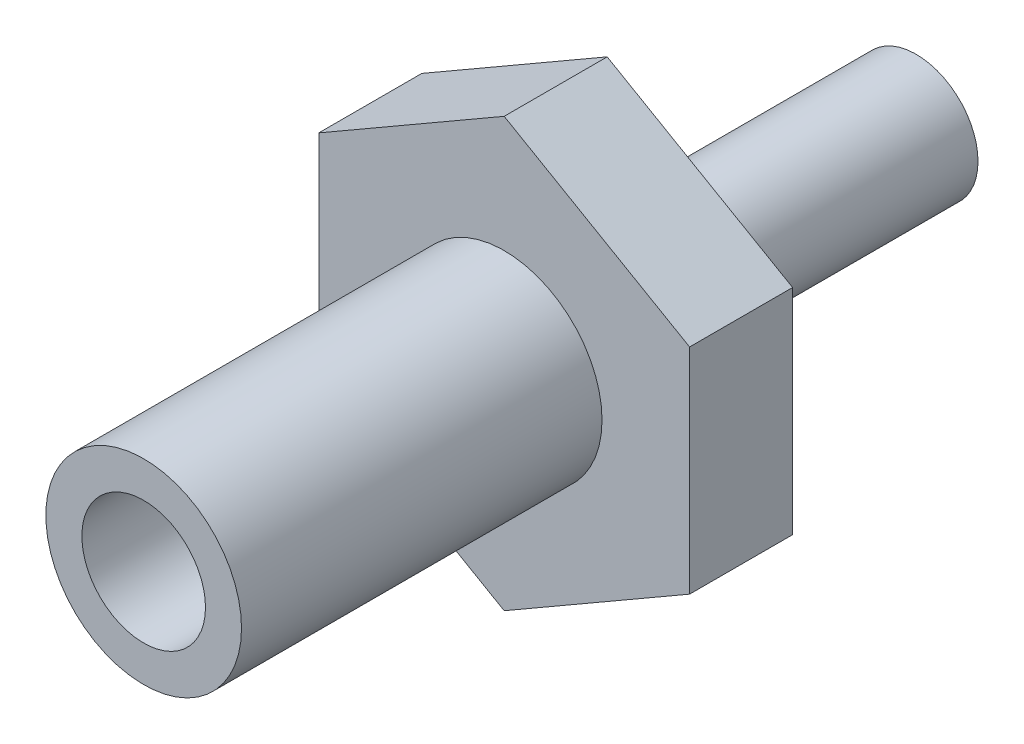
ISO-10303-21;
HEADER;
FILE_DESCRIPTION(('STEP AP214'),'2;1');
FILE_NAME('part.step','',(''),(''),'','','');
FILE_SCHEMA(('AUTOMOTIVE_DESIGN { 1 0 10303 214 1 1 1 1 }'));
ENDSEC;
DATA;
#1=APPLICATION_CONTEXT('core data for automotive mechanical design processes');
#2=APPLICATION_PROTOCOL_DEFINITION('international standard','automotive_design',2000,#1);
#3=PRODUCT_CONTEXT('',#1,'mechanical');
#4=PRODUCT('Part','Part','',(#3));
#5=PRODUCT_RELATED_PRODUCT_CATEGORY('part','',(#4));
#6=PRODUCT_DEFINITION_FORMATION('','',#4);
#7=PRODUCT_DEFINITION_CONTEXT('part definition',#1,'design');
#8=PRODUCT_DEFINITION('design','',#6,#7);
#9=PRODUCT_DEFINITION_SHAPE('','',#8);
#10=(LENGTH_UNIT() NAMED_UNIT(*) SI_UNIT(.MILLI.,.METRE.));
#11=(NAMED_UNIT(*) PLANE_ANGLE_UNIT() SI_UNIT($,.RADIAN.));
#12=(NAMED_UNIT(*) SI_UNIT($,.STERADIAN.) SOLID_ANGLE_UNIT());
#13=UNCERTAINTY_MEASURE_WITH_UNIT(LENGTH_MEASURE(1.E-05),#10,'distance_accuracy_value','');
#14=(GEOMETRIC_REPRESENTATION_CONTEXT(3) GLOBAL_UNCERTAINTY_ASSIGNED_CONTEXT((#13)) GLOBAL_UNIT_ASSIGNED_CONTEXT((#10,
#11,#12)) REPRESENTATION_CONTEXT('',''));
#15=CARTESIAN_POINT('',(0.,0.,0.));
#16=DIRECTION('',(0.,0.,1.));
#17=DIRECTION('',(1.,0.,0.));
#18=AXIS2_PLACEMENT_3D('',#15,#16,#17);
#19=CARTESIAN_POINT('',(22.,0.,10.));
#20=DIRECTION('',(0.,0.,-1.));
#21=DIRECTION('',(-1.,0.,0.));
#22=AXIS2_PLACEMENT_3D('',#19,#20,#21);
#23=PLANE('',#22);
#24=DIRECTION('',(-0.866025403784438,0.5,0.));
#25=VECTOR('',#24,1.);
#26=CARTESIAN_POINT('',(0.,-20.7846096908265,10.));
#27=LINE('',#26,#25);
#28=CARTESIAN_POINT('',(0.,-20.7846096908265,10.));
#29=VERTEX_POINT('',#28);
#30=CARTESIAN_POINT('',(-18.,-10.3923048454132,10.));
#31=VERTEX_POINT('',#30);
#32=EDGE_CURVE('E95',#29,#31,#27,.T.);
#33=ORIENTED_EDGE('',*,*,#32,.F.);
#34=DIRECTION('',(0.866025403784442,0.5,0.));
#35=VECTOR('',#34,1.);
#36=CARTESIAN_POINT('',(0.,-20.7846096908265,10.));
#37=LINE('',#36,#35);
#38=CARTESIAN_POINT('',(18.,-10.3923048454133,10.));
#39=VERTEX_POINT('',#38);
#40=EDGE_CURVE('E37',#29,#39,#37,.T.);
#41=ORIENTED_EDGE('',*,*,#40,.T.);
#42=DIRECTION('',(0.,-1.,0.));
#43=VECTOR('',#42,1.);
#44=CARTESIAN_POINT('',(18.,10.3923048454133,10.));
#45=LINE('',#44,#43);
#46=CARTESIAN_POINT('',(18.,10.3923048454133,10.));
#47=VERTEX_POINT('',#46);
#48=EDGE_CURVE('E74',#47,#39,#45,.T.);
#49=ORIENTED_EDGE('',*,*,#48,.F.);
#50=DIRECTION('',(0.866025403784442,-0.5,0.));
#51=VECTOR('',#50,1.);
#52=CARTESIAN_POINT('',(0.,20.7846096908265,10.));
#53=LINE('',#52,#51);
#54=CARTESIAN_POINT('',(0.,20.7846096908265,10.));
#55=VERTEX_POINT('',#54);
#56=EDGE_CURVE('E104',#55,#47,#53,.T.);
#57=ORIENTED_EDGE('',*,*,#56,.F.);
#58=DIRECTION('',(-0.866025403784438,-0.5,0.));
#59=VECTOR('',#58,1.);
#60=CARTESIAN_POINT('',(0.,20.7846096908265,10.));
#61=LINE('',#60,#59);
#62=CARTESIAN_POINT('',(-18.,10.3923048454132,10.));
#63=VERTEX_POINT('',#62);
#64=EDGE_CURVE('E101',#55,#63,#61,.T.);
#65=ORIENTED_EDGE('',*,*,#64,.T.);
#66=DIRECTION('',(0.,-1.,0.));
#67=VECTOR('',#66,1.);
#68=CARTESIAN_POINT('',(-18.,10.3923048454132,10.));
#69=LINE('',#68,#67);
#70=EDGE_CURVE('E98',#63,#31,#69,.T.);
#71=ORIENTED_EDGE('',*,*,#70,.T.);
#72=EDGE_LOOP('',(#33,#41,#49,#57,#65,#71));
#73=FACE_BOUND('',#72,.T.);
#74=CARTESIAN_POINT('',(0.,0.,10.));
#75=DIRECTION('',(0.,0.,1.));
#76=DIRECTION('',(1.,0.,0.));
#77=AXIS2_PLACEMENT_3D('',#74,#75,#76);
#78=CIRCLE('',#77,9.5);
#79=CARTESIAN_POINT('',(9.50000000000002,0.,10.));
#80=VERTEX_POINT('',#79);
#81=EDGE_CURVE('E9',#80,#80,#78,.T.);
#82=ORIENTED_EDGE('',*,*,#81,.F.);
#83=EDGE_LOOP('',(#82));
#84=FACE_BOUND('',#83,.T.);
#85=ADVANCED_FACE('F14',(#73,#84),#23,.F.);
#86=CARTESIAN_POINT('',(0.,0.,55.));
#87=DIRECTION('',(0.,0.,1.));
#88=DIRECTION('',(1.,0.,0.));
#89=AXIS2_PLACEMENT_3D('',#86,#87,#88);
#90=CYLINDRICAL_SURFACE('',#89,9.5);
#91=CARTESIAN_POINT('',(0.,0.,45.));
#92=DIRECTION('',(0.,0.,1.));
#93=DIRECTION('',(1.,0.,0.));
#94=AXIS2_PLACEMENT_3D('',#91,#92,#93);
#95=CIRCLE('',#94,9.5);
#96=CARTESIAN_POINT('',(9.50000000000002,0.,45.));
#97=VERTEX_POINT('',#96);
#98=EDGE_CURVE('E22',#97,#97,#95,.T.);
#99=ORIENTED_EDGE('',*,*,#98,.F.);
#100=EDGE_LOOP('',(#99));
#101=FACE_BOUND('',#100,.T.);
#102=ORIENTED_EDGE('',*,*,#81,.T.);
#103=EDGE_LOOP('',(#102));
#104=FACE_BOUND('',#103,.T.);
#105=ADVANCED_FACE('F133',(#101,#104),#90,.T.);
#106=CARTESIAN_POINT('',(9.5,0.,45.));
#107=DIRECTION('',(0.,0.,-1.));
#108=DIRECTION('',(-1.,0.,0.));
#109=AXIS2_PLACEMENT_3D('',#106,#107,#108);
#110=PLANE('',#109);
#111=CARTESIAN_POINT('',(0.,0.,45.));
#112=DIRECTION('',(0.,0.,1.));
#113=DIRECTION('',(1.,0.,0.));
#114=AXIS2_PLACEMENT_3D('',#111,#112,#113);
#115=CIRCLE('',#114,6.);
#116=CARTESIAN_POINT('',(6.00000000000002,0.,45.));
#117=VERTEX_POINT('',#116);
#118=EDGE_CURVE('E126',#117,#117,#115,.T.);
#119=ORIENTED_EDGE('',*,*,#118,.F.);
#120=EDGE_LOOP('',(#119));
#121=FACE_BOUND('',#120,.T.);
#122=ORIENTED_EDGE('',*,*,#98,.T.);
#123=EDGE_LOOP('',(#122));
#124=FACE_BOUND('',#123,.T.);
#125=ADVANCED_FACE('F131',(#121,#124),#110,.F.);
#126=CARTESIAN_POINT('',(0.,0.,55.));
#127=DIRECTION('',(0.,0.,1.));
#128=DIRECTION('',(1.,0.,0.));
#129=AXIS2_PLACEMENT_3D('',#126,#127,#128);
#130=CYLINDRICAL_SURFACE('',#129,6.);
#131=CARTESIAN_POINT('',(0.,0.,16.));
#132=DIRECTION('',(0.,0.,1.));
#133=DIRECTION('',(1.,0.,0.));
#134=AXIS2_PLACEMENT_3D('',#131,#132,#133);
#135=CIRCLE('',#134,6.);
#136=CARTESIAN_POINT('',(6.00000000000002,0.,16.));
#137=VERTEX_POINT('',#136);
#138=EDGE_CURVE('E123',#137,#137,#135,.T.);
#139=ORIENTED_EDGE('',*,*,#138,.F.);
#140=EDGE_LOOP('',(#139));
#141=FACE_BOUND('',#140,.T.);
#142=ORIENTED_EDGE('',*,*,#118,.T.);
#143=EDGE_LOOP('',(#142));
#144=FACE_BOUND('',#143,.T.);
#145=ADVANCED_FACE('F149',(#141,#144),#130,.F.);
#146=CARTESIAN_POINT('',(6.,0.,16.));
#147=DIRECTION('',(0.,0.,-1.));
#148=DIRECTION('',(-1.,0.,0.));
#149=AXIS2_PLACEMENT_3D('',#146,#147,#148);
#150=PLANE('',#149);
#151=ORIENTED_EDGE('',*,*,#138,.T.);
#152=EDGE_LOOP('',(#151));
#153=FACE_BOUND('',#152,.T.);
#154=ADVANCED_FACE('F153',(#153),#150,.F.);
#155=CARTESIAN_POINT('',(0.,-20.7846096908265,10.));
#156=DIRECTION('',(-0.5,0.866025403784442,0.));
#157=DIRECTION('',(-0.866025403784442,-0.5,0.));
#158=AXIS2_PLACEMENT_3D('',#155,#156,#157);
#159=PLANE('',#158);
#160=DIRECTION('',(0.,0.,-1.));
#161=VECTOR('',#160,1.);
#162=CARTESIAN_POINT('',(18.,-10.3923048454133,10.));
#163=LINE('',#162,#161);
#164=CARTESIAN_POINT('',(18.,-10.3923048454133,0.));
#165=VERTEX_POINT('',#164);
#166=EDGE_CURVE('E67',#39,#165,#163,.T.);
#167=ORIENTED_EDGE('',*,*,#166,.F.);
#168=ORIENTED_EDGE('',*,*,#40,.F.);
#169=DIRECTION('',(0.,0.,-1.));
#170=VECTOR('',#169,1.);
#171=CARTESIAN_POINT('',(0.,-20.7846096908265,10.));
#172=LINE('',#171,#170);
#173=CARTESIAN_POINT('',(0.,-20.7846096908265,0.));
#174=VERTEX_POINT('',#173);
#175=EDGE_CURVE('E81',#29,#174,#172,.T.);
#176=ORIENTED_EDGE('',*,*,#175,.T.);
#177=DIRECTION('',(0.866025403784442,0.5,0.));
#178=VECTOR('',#177,1.);
#179=CARTESIAN_POINT('',(0.,-20.7846096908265,0.));
#180=LINE('',#179,#178);
#181=EDGE_CURVE('E79',#174,#165,#180,.T.);
#182=ORIENTED_EDGE('',*,*,#181,.T.);
#183=EDGE_LOOP('',(#167,#168,#176,#182));
#184=FACE_BOUND('',#183,.T.);
#185=ADVANCED_FACE('F80',(#184),#159,.F.);
#186=CARTESIAN_POINT('',(18.,10.3923048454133,10.));
#187=DIRECTION('',(1.,0.,0.));
#188=DIRECTION('',(0.,0.,-1.));
#189=AXIS2_PLACEMENT_3D('',#186,#187,#188);
#190=PLANE('',#189);
#191=DIRECTION('',(0.,0.,-1.));
#192=VECTOR('',#191,1.);
#193=CARTESIAN_POINT('',(18.,10.3923048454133,10.));
#194=LINE('',#193,#192);
#195=CARTESIAN_POINT('',(18.,10.3923048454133,0.));
#196=VERTEX_POINT('',#195);
#197=EDGE_CURVE('E76',#47,#196,#194,.T.);
#198=ORIENTED_EDGE('',*,*,#197,.F.);
#199=ORIENTED_EDGE('',*,*,#48,.T.);
#200=ORIENTED_EDGE('',*,*,#166,.T.);
#201=DIRECTION('',(0.,-1.,0.));
#202=VECTOR('',#201,1.);
#203=CARTESIAN_POINT('',(18.,10.3923048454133,0.));
#204=LINE('',#203,#202);
#205=EDGE_CURVE('E71',#196,#165,#204,.T.);
#206=ORIENTED_EDGE('',*,*,#205,.F.);
#207=EDGE_LOOP('',(#198,#199,#200,#206));
#208=FACE_BOUND('',#207,.T.);
#209=ADVANCED_FACE('F69',(#208),#190,.T.);
#210=CARTESIAN_POINT('',(0.,20.7846096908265,10.));
#211=DIRECTION('',(0.5,0.866025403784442,0.));
#212=DIRECTION('',(-0.866025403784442,0.5,0.));
#213=AXIS2_PLACEMENT_3D('',#210,#211,#212);
#214=PLANE('',#213);
#215=DIRECTION('',(0.,0.,-1.));
#216=VECTOR('',#215,1.);
#217=CARTESIAN_POINT('',(0.,20.7846096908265,10.));
#218=LINE('',#217,#216);
#219=CARTESIAN_POINT('',(0.,20.7846096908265,0.));
#220=VERTEX_POINT('',#219);
#221=EDGE_CURVE('E115',#55,#220,#218,.T.);
#222=ORIENTED_EDGE('',*,*,#221,.F.);
#223=ORIENTED_EDGE('',*,*,#56,.T.);
#224=ORIENTED_EDGE('',*,*,#197,.T.);
#225=DIRECTION('',(0.866025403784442,-0.5,0.));
#226=VECTOR('',#225,1.);
#227=CARTESIAN_POINT('',(0.,20.7846096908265,0.));
#228=LINE('',#227,#226);
#229=EDGE_CURVE('E89',#220,#196,#228,.T.);
#230=ORIENTED_EDGE('',*,*,#229,.F.);
#231=EDGE_LOOP('',(#222,#223,#224,#230));
#232=FACE_BOUND('',#231,.T.);
#233=ADVANCED_FACE('F169',(#232),#214,.T.);
#234=CARTESIAN_POINT('',(0.,20.7846096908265,10.));
#235=DIRECTION('',(0.5,-0.866025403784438,0.));
#236=DIRECTION('',(0.866025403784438,0.5,0.));
#237=AXIS2_PLACEMENT_3D('',#234,#235,#236);
#238=PLANE('',#237);
#239=DIRECTION('',(0.,0.,-1.));
#240=VECTOR('',#239,1.);
#241=CARTESIAN_POINT('',(-18.,10.3923048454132,10.));
#242=LINE('',#241,#240);
#243=CARTESIAN_POINT('',(-18.,10.3923048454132,0.));
#244=VERTEX_POINT('',#243);
#245=EDGE_CURVE('E113',#63,#244,#242,.T.);
#246=ORIENTED_EDGE('',*,*,#245,.F.);
#247=ORIENTED_EDGE('',*,*,#64,.F.);
#248=ORIENTED_EDGE('',*,*,#221,.T.);
#249=DIRECTION('',(-0.866025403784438,-0.5,0.));
#250=VECTOR('',#249,1.);
#251=CARTESIAN_POINT('',(0.,20.7846096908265,0.));
#252=LINE('',#251,#250);
#253=EDGE_CURVE('E91',#220,#244,#252,.T.);
#254=ORIENTED_EDGE('',*,*,#253,.T.);
#255=EDGE_LOOP('',(#246,#247,#248,#254));
#256=FACE_BOUND('',#255,.T.);
#257=ADVANCED_FACE('F172',(#256),#238,.F.);
#258=CARTESIAN_POINT('',(-18.,10.3923048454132,10.));
#259=DIRECTION('',(1.,0.,0.));
#260=DIRECTION('',(0.,1.,0.));
#261=AXIS2_PLACEMENT_3D('',#258,#259,#260);
#262=PLANE('',#261);
#263=DIRECTION('',(0.,0.,-1.));
#264=VECTOR('',#263,1.);
#265=CARTESIAN_POINT('',(-18.,-10.3923048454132,10.));
#266=LINE('',#265,#264);
#267=CARTESIAN_POINT('',(-18.,-10.3923048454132,0.));
#268=VERTEX_POINT('',#267);
#269=EDGE_CURVE('E111',#31,#268,#266,.T.);
#270=ORIENTED_EDGE('',*,*,#269,.F.);
#271=ORIENTED_EDGE('',*,*,#70,.F.);
#272=ORIENTED_EDGE('',*,*,#245,.T.);
#273=DIRECTION('',(0.,-1.,0.));
#274=VECTOR('',#273,1.);
#275=CARTESIAN_POINT('',(-18.,10.3923048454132,0.));
#276=LINE('',#275,#274);
#277=EDGE_CURVE('E29',#244,#268,#276,.T.);
#278=ORIENTED_EDGE('',*,*,#277,.T.);
#279=EDGE_LOOP('',(#270,#271,#272,#278));
#280=FACE_BOUND('',#279,.T.);
#281=ADVANCED_FACE('F176',(#280),#262,.F.);
#282=CARTESIAN_POINT('',(0.,-20.7846096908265,10.));
#283=DIRECTION('',(-0.5,-0.866025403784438,0.));
#284=DIRECTION('',(0.866025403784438,-0.5,0.));
#285=AXIS2_PLACEMENT_3D('',#282,#283,#284);
#286=PLANE('',#285);
#287=ORIENTED_EDGE('',*,*,#32,.T.);
#288=ORIENTED_EDGE('',*,*,#269,.T.);
#289=DIRECTION('',(-0.866025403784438,0.5,0.));
#290=VECTOR('',#289,1.);
#291=CARTESIAN_POINT('',(0.,-20.7846096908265,0.));
#292=LINE('',#291,#290);
#293=EDGE_CURVE('E109',#174,#268,#292,.T.);
#294=ORIENTED_EDGE('',*,*,#293,.F.);
#295=ORIENTED_EDGE('',*,*,#175,.F.);
#296=EDGE_LOOP('',(#287,#288,#294,#295));
#297=FACE_BOUND('',#296,.T.);
#298=ADVANCED_FACE('F162',(#297),#286,.T.);
#299=CARTESIAN_POINT('',(0.,0.,-30.));
#300=DIRECTION('',(0.,0.,1.));
#301=DIRECTION('',(1.,0.,0.));
#302=AXIS2_PLACEMENT_3D('',#299,#300,#301);
#303=PLANE('',#302);
#304=CARTESIAN_POINT('',(0.,0.,-30.));
#305=DIRECTION('',(0.,0.,1.));
#306=DIRECTION('',(1.,0.,0.));
#307=AXIS2_PLACEMENT_3D('',#304,#305,#306);
#308=CIRCLE('',#307,6.);
#309=CARTESIAN_POINT('',(6.00000000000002,0.,-30.));
#310=VERTEX_POINT('',#309);
#311=EDGE_CURVE('E120',#310,#310,#308,.T.);
#312=ORIENTED_EDGE('',*,*,#311,.F.);
#313=EDGE_LOOP('',(#312));
#314=FACE_BOUND('',#313,.T.);
#315=ADVANCED_FACE('F158',(#314),#303,.F.);
#316=CARTESIAN_POINT('',(0.,0.,55.));
#317=DIRECTION('',(0.,0.,1.));
#318=DIRECTION('',(1.,0.,0.));
#319=AXIS2_PLACEMENT_3D('',#316,#317,#318);
#320=CYLINDRICAL_SURFACE('',#319,6.);
#321=CARTESIAN_POINT('',(0.,0.,0.));
#322=DIRECTION('',(0.,0.,1.));
#323=DIRECTION('',(1.,0.,0.));
#324=AXIS2_PLACEMENT_3D('',#321,#322,#323);
#325=CIRCLE('',#324,6.00000000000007);
#326=CARTESIAN_POINT('',(6.00000000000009,0.,0.));
#327=VERTEX_POINT('',#326);
#328=EDGE_CURVE('E75',#327,#327,#325,.T.);
#329=ORIENTED_EDGE('',*,*,#328,.F.);
#330=EDGE_LOOP('',(#329));
#331=FACE_BOUND('',#330,.T.);
#332=ORIENTED_EDGE('',*,*,#311,.T.);
#333=EDGE_LOOP('',(#332));
#334=FACE_BOUND('',#333,.T.);
#335=ADVANCED_FACE('F161',(#331,#334),#320,.T.);
#336=CARTESIAN_POINT('',(6.00000000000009,0.,0.));
#337=DIRECTION('',(0.,0.,1.));
#338=DIRECTION('',(1.,0.,0.));
#339=AXIS2_PLACEMENT_3D('',#336,#337,#338);
#340=PLANE('',#339);
#341=ORIENTED_EDGE('',*,*,#205,.T.);
#342=ORIENTED_EDGE('',*,*,#181,.F.);
#343=ORIENTED_EDGE('',*,*,#293,.T.);
#344=ORIENTED_EDGE('',*,*,#277,.F.);
#345=ORIENTED_EDGE('',*,*,#253,.F.);
#346=ORIENTED_EDGE('',*,*,#229,.T.);
#347=EDGE_LOOP('',(#341,#342,#343,#344,#345,#346));
#348=FACE_BOUND('',#347,.T.);
#349=ORIENTED_EDGE('',*,*,#328,.T.);
#350=EDGE_LOOP('',(#349));
#351=FACE_BOUND('',#350,.T.);
#352=ADVANCED_FACE('F16',(#348,#351),#340,.F.);
#353=CLOSED_SHELL('',(#85,#105,#125,#145,#154,#185,#209,#233,#257,#281,#298,#315,#335,#352));
#354=MANIFOLD_SOLID_BREP('B1',#353);
#355=ADVANCED_BREP_SHAPE_REPRESENTATION('',(#18,#354),#14);
#356=SHAPE_DEFINITION_REPRESENTATION(#9,#355);
ENDSEC;
END-ISO-10303-21;
